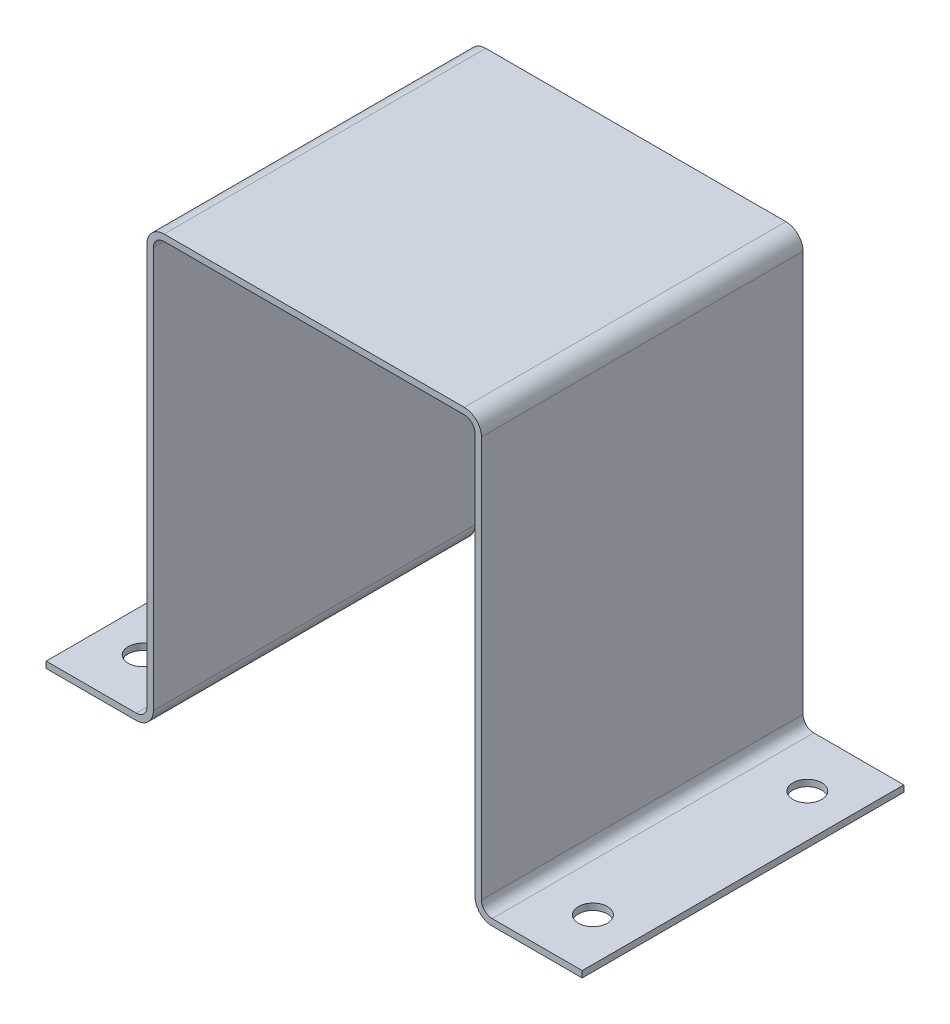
ISO-10303-21;
HEADER;
FILE_DESCRIPTION(('STEP AP214'),'2;1');
FILE_NAME('part.step','',(''),(''),'','','');
FILE_SCHEMA(('AUTOMOTIVE_DESIGN { 1 0 10303 214 1 1 1 1 }'));
ENDSEC;
DATA;
#1=APPLICATION_CONTEXT('core data for automotive mechanical design processes');
#2=APPLICATION_PROTOCOL_DEFINITION('international standard','automotive_design',2000,#1);
#3=PRODUCT_CONTEXT('',#1,'mechanical');
#4=PRODUCT('Part','Part','',(#3));
#5=PRODUCT_RELATED_PRODUCT_CATEGORY('part','',(#4));
#6=PRODUCT_DEFINITION_FORMATION('','',#4);
#7=PRODUCT_DEFINITION_CONTEXT('part definition',#1,'design');
#8=PRODUCT_DEFINITION('design','',#6,#7);
#9=PRODUCT_DEFINITION_SHAPE('','',#8);
#10=(LENGTH_UNIT() NAMED_UNIT(*) SI_UNIT(.MILLI.,.METRE.));
#11=(NAMED_UNIT(*) PLANE_ANGLE_UNIT() SI_UNIT($,.RADIAN.));
#12=(NAMED_UNIT(*) SI_UNIT($,.STERADIAN.) SOLID_ANGLE_UNIT());
#13=UNCERTAINTY_MEASURE_WITH_UNIT(LENGTH_MEASURE(1.E-05),#10,'distance_accuracy_value','');
#14=(GEOMETRIC_REPRESENTATION_CONTEXT(3) GLOBAL_UNCERTAINTY_ASSIGNED_CONTEXT((#13)) GLOBAL_UNIT_ASSIGNED_CONTEXT((#10,
#11,#12)) REPRESENTATION_CONTEXT('',''));
#15=CARTESIAN_POINT('',(0.,0.,0.));
#16=DIRECTION('',(0.,0.,1.));
#17=DIRECTION('',(1.,0.,0.));
#18=AXIS2_PLACEMENT_3D('',#15,#16,#17);
#19=CARTESIAN_POINT('',(-83.,-197.,75.));
#20=DIRECTION('',(0.,-1.,0.));
#21=DIRECTION('',(0.,0.,-1.));
#22=AXIS2_PLACEMENT_3D('',#19,#20,#21);
#23=PLANE('',#22);
#24=CARTESIAN_POINT('',(-105.,-197.,-50.));
#25=DIRECTION('',(0.,1.,0.));
#26=DIRECTION('',(0.,0.,1.));
#27=AXIS2_PLACEMENT_3D('',#24,#25,#26);
#28=CIRCLE('',#27,6.75000000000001);
#29=CARTESIAN_POINT('',(-105.,-197.,-43.25));
#30=VERTEX_POINT('',#29);
#31=EDGE_CURVE('E372',#30,#30,#28,.T.);
#32=ORIENTED_EDGE('',*,*,#31,.F.);
#33=EDGE_LOOP('',(#32));
#34=FACE_BOUND('',#33,.T.);
#35=CARTESIAN_POINT('',(-105.,-197.,50.));
#36=DIRECTION('',(0.,1.,0.));
#37=DIRECTION('',(0.,0.,1.));
#38=AXIS2_PLACEMENT_3D('',#35,#36,#37);
#39=CIRCLE('',#38,6.75000000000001);
#40=CARTESIAN_POINT('',(-105.,-197.,56.75));
#41=VERTEX_POINT('',#40);
#42=EDGE_CURVE('E375',#41,#41,#39,.T.);
#43=ORIENTED_EDGE('',*,*,#42,.F.);
#44=EDGE_LOOP('',(#43));
#45=FACE_BOUND('',#44,.T.);
#46=DIRECTION('',(1.,0.,0.));
#47=VECTOR('',#46,1.);
#48=CARTESIAN_POINT('',(-83.,-197.,-75.));
#49=LINE('',#48,#47);
#50=CARTESIAN_POINT('',(-83.,-197.,-75.));
#51=VERTEX_POINT('',#50);
#52=CARTESIAN_POINT('',(-125.,-197.,-75.));
#53=VERTEX_POINT('',#52);
#54=EDGE_CURVE('E201',#51,#53,#49,.F.);
#55=ORIENTED_EDGE('',*,*,#54,.T.);
#56=DIRECTION('',(0.,0.,-1.));
#57=VECTOR('',#56,1.);
#58=CARTESIAN_POINT('',(-125.,-197.,75.));
#59=LINE('',#58,#57);
#60=CARTESIAN_POINT('',(-125.,-197.,75.));
#61=VERTEX_POINT('',#60);
#62=EDGE_CURVE('E11',#61,#53,#59,.T.);
#63=ORIENTED_EDGE('',*,*,#62,.F.);
#64=DIRECTION('',(1.,0.,0.));
#65=VECTOR('',#64,1.);
#66=CARTESIAN_POINT('',(-83.,-197.,75.));
#67=LINE('',#66,#65);
#68=CARTESIAN_POINT('',(-83.,-197.,75.));
#69=VERTEX_POINT('',#68);
#70=EDGE_CURVE('E126',#69,#61,#67,.F.);
#71=ORIENTED_EDGE('',*,*,#70,.F.);
#72=DIRECTION('',(0.,0.,-1.));
#73=VECTOR('',#72,1.);
#74=CARTESIAN_POINT('',(-83.,-197.,75.));
#75=LINE('',#74,#73);
#76=EDGE_CURVE('E197',#69,#51,#75,.T.);
#77=ORIENTED_EDGE('',*,*,#76,.T.);
#78=EDGE_LOOP('',(#55,#63,#71,#77));
#79=FACE_BOUND('',#78,.T.);
#80=ADVANCED_FACE('F34',(#34,#45,#79),#23,.F.);
#81=CARTESIAN_POINT('',(-125.,-200.,75.));
#82=DIRECTION('',(-1.,0.,0.));
#83=DIRECTION('',(0.,0.,1.));
#84=AXIS2_PLACEMENT_3D('',#81,#82,#83);
#85=PLANE('',#84);
#86=DIRECTION('',(0.,1.,0.));
#87=VECTOR('',#86,1.);
#88=CARTESIAN_POINT('',(-125.,-200.,-75.));
#89=LINE('',#88,#87);
#90=CARTESIAN_POINT('',(-125.,-200.,-75.));
#91=VERTEX_POINT('',#90);
#92=EDGE_CURVE('E204',#91,#53,#89,.T.);
#93=ORIENTED_EDGE('',*,*,#92,.F.);
#94=DIRECTION('',(0.,0.,-1.));
#95=VECTOR('',#94,1.);
#96=CARTESIAN_POINT('',(-125.,-200.,75.));
#97=LINE('',#96,#95);
#98=CARTESIAN_POINT('',(-125.,-200.,75.));
#99=VERTEX_POINT('',#98);
#100=EDGE_CURVE('E42',#99,#91,#97,.T.);
#101=ORIENTED_EDGE('',*,*,#100,.F.);
#102=DIRECTION('',(0.,1.,0.));
#103=VECTOR('',#102,1.);
#104=CARTESIAN_POINT('',(-125.,-200.,75.));
#105=LINE('',#104,#103);
#106=EDGE_CURVE('E307',#99,#61,#105,.T.);
#107=ORIENTED_EDGE('',*,*,#106,.T.);
#108=ORIENTED_EDGE('',*,*,#62,.T.);
#109=EDGE_LOOP('',(#93,#101,#107,#108));
#110=FACE_BOUND('',#109,.T.);
#111=ADVANCED_FACE('F294',(#110),#85,.T.);
#112=CARTESIAN_POINT('',(-83.,-200.,75.));
#113=DIRECTION('',(0.,-1.,0.));
#114=DIRECTION('',(0.,0.,-1.));
#115=AXIS2_PLACEMENT_3D('',#112,#113,#114);
#116=PLANE('',#115);
#117=CARTESIAN_POINT('',(-105.,-200.,-50.));
#118=DIRECTION('',(0.,1.,0.));
#119=DIRECTION('',(0.,0.,1.));
#120=AXIS2_PLACEMENT_3D('',#117,#118,#119);
#121=CIRCLE('',#120,6.75000000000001);
#122=CARTESIAN_POINT('',(-105.,-200.,-43.25));
#123=VERTEX_POINT('',#122);
#124=EDGE_CURVE('E378',#123,#123,#121,.T.);
#125=ORIENTED_EDGE('',*,*,#124,.T.);
#126=EDGE_LOOP('',(#125));
#127=FACE_BOUND('',#126,.T.);
#128=CARTESIAN_POINT('',(-105.,-200.,50.));
#129=DIRECTION('',(0.,1.,0.));
#130=DIRECTION('',(0.,0.,1.));
#131=AXIS2_PLACEMENT_3D('',#128,#129,#130);
#132=CIRCLE('',#131,6.75000000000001);
#133=CARTESIAN_POINT('',(-105.,-200.,56.75));
#134=VERTEX_POINT('',#133);
#135=EDGE_CURVE('E377',#134,#134,#132,.T.);
#136=ORIENTED_EDGE('',*,*,#135,.T.);
#137=EDGE_LOOP('',(#136));
#138=FACE_BOUND('',#137,.T.);
#139=DIRECTION('',(-1.,0.,0.));
#140=VECTOR('',#139,1.);
#141=CARTESIAN_POINT('',(-83.,-200.,-75.));
#142=LINE('',#141,#140);
#143=CARTESIAN_POINT('',(-83.,-200.,-75.));
#144=VERTEX_POINT('',#143);
#145=EDGE_CURVE('E208',#144,#91,#142,.T.);
#146=ORIENTED_EDGE('',*,*,#145,.F.);
#147=DIRECTION('',(0.,0.,-1.));
#148=VECTOR('',#147,1.);
#149=CARTESIAN_POINT('',(-83.,-200.,75.));
#150=LINE('',#149,#148);
#151=CARTESIAN_POINT('',(-83.,-200.,75.));
#152=VERTEX_POINT('',#151);
#153=EDGE_CURVE('E284',#152,#144,#150,.T.);
#154=ORIENTED_EDGE('',*,*,#153,.F.);
#155=DIRECTION('',(-1.,0.,0.));
#156=VECTOR('',#155,1.);
#157=CARTESIAN_POINT('',(-83.,-200.,75.));
#158=LINE('',#157,#156);
#159=EDGE_CURVE('E291',#152,#99,#158,.T.);
#160=ORIENTED_EDGE('',*,*,#159,.T.);
#161=ORIENTED_EDGE('',*,*,#100,.T.);
#162=EDGE_LOOP('',(#146,#154,#160,#161));
#163=FACE_BOUND('',#162,.T.);
#164=ADVANCED_FACE('F289',(#127,#138,#163),#116,.T.);
#165=CARTESIAN_POINT('',(-83.,-192.,75.));
#166=DIRECTION('',(0.,0.,-1.));
#167=DIRECTION('',(-1.,0.,0.));
#168=AXIS2_PLACEMENT_3D('',#165,#166,#167);
#169=CYLINDRICAL_SURFACE('',#168,7.99999999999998);
#170=CARTESIAN_POINT('',(-83.,-192.,-75.));
#171=DIRECTION('',(0.,0.,-1.));
#172=DIRECTION('',(-1.,0.,0.));
#173=AXIS2_PLACEMENT_3D('',#170,#171,#172);
#174=CIRCLE('',#173,7.99999999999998);
#175=CARTESIAN_POINT('',(-75.,-192.,-75.));
#176=VERTEX_POINT('',#175);
#177=EDGE_CURVE('E211',#176,#144,#174,.T.);
#178=ORIENTED_EDGE('',*,*,#177,.F.);
#179=DIRECTION('',(0.,0.,-1.));
#180=VECTOR('',#179,1.);
#181=CARTESIAN_POINT('',(-75.,-192.,75.));
#182=LINE('',#181,#180);
#183=CARTESIAN_POINT('',(-75.,-192.,75.));
#184=VERTEX_POINT('',#183);
#185=EDGE_CURVE('E282',#184,#176,#182,.T.);
#186=ORIENTED_EDGE('',*,*,#185,.F.);
#187=CARTESIAN_POINT('',(-83.,-192.,75.));
#188=DIRECTION('',(0.,0.,-1.));
#189=DIRECTION('',(-1.,0.,0.));
#190=AXIS2_PLACEMENT_3D('',#187,#188,#189);
#191=CIRCLE('',#190,7.99999999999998);
#192=EDGE_CURVE('E304',#184,#152,#191,.T.);
#193=ORIENTED_EDGE('',*,*,#192,.T.);
#194=ORIENTED_EDGE('',*,*,#153,.T.);
#195=EDGE_LOOP('',(#178,#186,#193,#194));
#196=FACE_BOUND('',#195,.T.);
#197=ADVANCED_FACE('F301',(#196),#169,.T.);
#198=CARTESIAN_POINT('',(-75.,-5.,75.));
#199=DIRECTION('',(1.,0.,0.));
#200=DIRECTION('',(0.,1.,0.));
#201=AXIS2_PLACEMENT_3D('',#198,#199,#200);
#202=PLANE('',#201);
#203=DIRECTION('',(0.,-1.,0.));
#204=VECTOR('',#203,1.);
#205=CARTESIAN_POINT('',(-75.,-5.,-75.));
#206=LINE('',#205,#204);
#207=CARTESIAN_POINT('',(-75.,-5.,-75.));
#208=VERTEX_POINT('',#207);
#209=EDGE_CURVE('E214',#208,#176,#206,.T.);
#210=ORIENTED_EDGE('',*,*,#209,.F.);
#211=DIRECTION('',(0.,0.,-1.));
#212=VECTOR('',#211,1.);
#213=CARTESIAN_POINT('',(-75.,-5.,75.));
#214=LINE('',#213,#212);
#215=CARTESIAN_POINT('',(-75.,-5.,75.));
#216=VERTEX_POINT('',#215);
#217=EDGE_CURVE('E280',#216,#208,#214,.T.);
#218=ORIENTED_EDGE('',*,*,#217,.F.);
#219=DIRECTION('',(0.,-1.,0.));
#220=VECTOR('',#219,1.);
#221=CARTESIAN_POINT('',(-75.,-5.,75.));
#222=LINE('',#221,#220);
#223=EDGE_CURVE('E309',#216,#184,#222,.T.);
#224=ORIENTED_EDGE('',*,*,#223,.T.);
#225=ORIENTED_EDGE('',*,*,#185,.T.);
#226=EDGE_LOOP('',(#210,#218,#224,#225));
#227=FACE_BOUND('',#226,.T.);
#228=ADVANCED_FACE('F461',(#227),#202,.T.);
#229=CARTESIAN_POINT('',(-70.,-5.,75.));
#230=DIRECTION('',(0.,0.,-1.));
#231=DIRECTION('',(-1.,0.,0.));
#232=AXIS2_PLACEMENT_3D('',#229,#230,#231);
#233=CYLINDRICAL_SURFACE('',#232,5.);
#234=CARTESIAN_POINT('',(-70.,-5.,-75.));
#235=DIRECTION('',(0.,0.,1.));
#236=DIRECTION('',(1.,0.,0.));
#237=AXIS2_PLACEMENT_3D('',#234,#235,#236);
#238=CIRCLE('',#237,5.);
#239=CARTESIAN_POINT('',(-70.,0.,-75.));
#240=VERTEX_POINT('',#239);
#241=EDGE_CURVE('E217',#240,#208,#238,.T.);
#242=ORIENTED_EDGE('',*,*,#241,.F.);
#243=DIRECTION('',(0.,0.,-1.));
#244=VECTOR('',#243,1.);
#245=CARTESIAN_POINT('',(-70.,0.,75.));
#246=LINE('',#245,#244);
#247=CARTESIAN_POINT('',(-70.,0.,75.));
#248=VERTEX_POINT('',#247);
#249=EDGE_CURVE('E278',#248,#240,#246,.T.);
#250=ORIENTED_EDGE('',*,*,#249,.F.);
#251=CARTESIAN_POINT('',(-70.,-5.,75.));
#252=DIRECTION('',(0.,0.,1.));
#253=DIRECTION('',(1.,0.,0.));
#254=AXIS2_PLACEMENT_3D('',#251,#252,#253);
#255=CIRCLE('',#254,5.);
#256=EDGE_CURVE('E315',#248,#216,#255,.T.);
#257=ORIENTED_EDGE('',*,*,#256,.T.);
#258=ORIENTED_EDGE('',*,*,#217,.T.);
#259=EDGE_LOOP('',(#242,#250,#257,#258));
#260=FACE_BOUND('',#259,.T.);
#261=ADVANCED_FACE('F457',(#260),#233,.F.);
#262=CARTESIAN_POINT('',(-70.,0.,75.));
#263=DIRECTION('',(0.,-1.,0.));
#264=DIRECTION('',(0.,0.,-1.));
#265=AXIS2_PLACEMENT_3D('',#262,#263,#264);
#266=PLANE('',#265);
#267=DIRECTION('',(-1.,0.,0.));
#268=VECTOR('',#267,1.);
#269=CARTESIAN_POINT('',(-70.,0.,-75.));
#270=LINE('',#269,#268);
#271=CARTESIAN_POINT('',(70.,0.,-75.));
#272=VERTEX_POINT('',#271);
#273=EDGE_CURVE('E220',#272,#240,#270,.T.);
#274=ORIENTED_EDGE('',*,*,#273,.F.);
#275=DIRECTION('',(0.,0.,-1.));
#276=VECTOR('',#275,1.);
#277=CARTESIAN_POINT('',(70.,0.,75.));
#278=LINE('',#277,#276);
#279=CARTESIAN_POINT('',(70.,0.,75.));
#280=VERTEX_POINT('',#279);
#281=EDGE_CURVE('E276',#280,#272,#278,.T.);
#282=ORIENTED_EDGE('',*,*,#281,.F.);
#283=DIRECTION('',(-1.,0.,0.));
#284=VECTOR('',#283,1.);
#285=CARTESIAN_POINT('',(-70.,0.,75.));
#286=LINE('',#285,#284);
#287=EDGE_CURVE('E318',#280,#248,#286,.T.);
#288=ORIENTED_EDGE('',*,*,#287,.T.);
#289=ORIENTED_EDGE('',*,*,#249,.T.);
#290=EDGE_LOOP('',(#274,#282,#288,#289));
#291=FACE_BOUND('',#290,.T.);
#292=ADVANCED_FACE('F453',(#291),#266,.T.);
#293=CARTESIAN_POINT('',(70.,-5.,75.));
#294=DIRECTION('',(0.,0.,-1.));
#295=DIRECTION('',(-1.,0.,0.));
#296=AXIS2_PLACEMENT_3D('',#293,#294,#295);
#297=CYLINDRICAL_SURFACE('',#296,5.);
#298=CARTESIAN_POINT('',(70.,-5.,-75.));
#299=DIRECTION('',(0.,0.,1.));
#300=DIRECTION('',(-1.,0.,0.));
#301=AXIS2_PLACEMENT_3D('',#298,#299,#300);
#302=CIRCLE('',#301,5.);
#303=CARTESIAN_POINT('',(75.,-5.,-75.));
#304=VERTEX_POINT('',#303);
#305=EDGE_CURVE('E223',#304,#272,#302,.T.);
#306=ORIENTED_EDGE('',*,*,#305,.F.);
#307=DIRECTION('',(0.,0.,-1.));
#308=VECTOR('',#307,1.);
#309=CARTESIAN_POINT('',(75.,-5.,75.));
#310=LINE('',#309,#308);
#311=CARTESIAN_POINT('',(75.,-5.,75.));
#312=VERTEX_POINT('',#311);
#313=EDGE_CURVE('E274',#312,#304,#310,.T.);
#314=ORIENTED_EDGE('',*,*,#313,.F.);
#315=CARTESIAN_POINT('',(70.,-5.,75.));
#316=DIRECTION('',(0.,0.,1.));
#317=DIRECTION('',(-1.,0.,0.));
#318=AXIS2_PLACEMENT_3D('',#315,#316,#317);
#319=CIRCLE('',#318,5.);
#320=EDGE_CURVE('E321',#312,#280,#319,.T.);
#321=ORIENTED_EDGE('',*,*,#320,.T.);
#322=ORIENTED_EDGE('',*,*,#281,.T.);
#323=EDGE_LOOP('',(#306,#314,#321,#322));
#324=FACE_BOUND('',#323,.T.);
#325=ADVANCED_FACE('F449',(#324),#297,.F.);
#326=CARTESIAN_POINT('',(75.,-5.,75.));
#327=DIRECTION('',(-1.,0.,0.));
#328=DIRECTION('',(0.,-1.,0.));
#329=AXIS2_PLACEMENT_3D('',#326,#327,#328);
#330=PLANE('',#329);
#331=DIRECTION('',(0.,1.,0.));
#332=VECTOR('',#331,1.);
#333=CARTESIAN_POINT('',(75.,-5.,-75.));
#334=LINE('',#333,#332);
#335=CARTESIAN_POINT('',(75.,-192.,-75.));
#336=VERTEX_POINT('',#335);
#337=EDGE_CURVE('E226',#336,#304,#334,.T.);
#338=ORIENTED_EDGE('',*,*,#337,.F.);
#339=DIRECTION('',(0.,0.,-1.));
#340=VECTOR('',#339,1.);
#341=CARTESIAN_POINT('',(75.,-192.,75.));
#342=LINE('',#341,#340);
#343=CARTESIAN_POINT('',(75.,-192.,75.));
#344=VERTEX_POINT('',#343);
#345=EDGE_CURVE('E272',#344,#336,#342,.T.);
#346=ORIENTED_EDGE('',*,*,#345,.F.);
#347=DIRECTION('',(0.,1.,0.));
#348=VECTOR('',#347,1.);
#349=CARTESIAN_POINT('',(75.,-5.,75.));
#350=LINE('',#349,#348);
#351=EDGE_CURVE('E324',#344,#312,#350,.T.);
#352=ORIENTED_EDGE('',*,*,#351,.T.);
#353=ORIENTED_EDGE('',*,*,#313,.T.);
#354=EDGE_LOOP('',(#338,#346,#352,#353));
#355=FACE_BOUND('',#354,.T.);
#356=ADVANCED_FACE('F445',(#355),#330,.T.);
#357=CARTESIAN_POINT('',(83.,-192.,75.));
#358=DIRECTION('',(0.,0.,-1.));
#359=DIRECTION('',(-1.,0.,0.));
#360=AXIS2_PLACEMENT_3D('',#357,#358,#359);
#361=CYLINDRICAL_SURFACE('',#360,8.00000000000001);
#362=CARTESIAN_POINT('',(83.,-192.,-75.));
#363=DIRECTION('',(0.,0.,-1.));
#364=DIRECTION('',(1.,0.,0.));
#365=AXIS2_PLACEMENT_3D('',#362,#363,#364);
#366=CIRCLE('',#365,8.00000000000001);
#367=CARTESIAN_POINT('',(83.,-200.,-75.));
#368=VERTEX_POINT('',#367);
#369=EDGE_CURVE('E229',#368,#336,#366,.T.);
#370=ORIENTED_EDGE('',*,*,#369,.F.);
#371=DIRECTION('',(0.,0.,-1.));
#372=VECTOR('',#371,1.);
#373=CARTESIAN_POINT('',(83.,-200.,75.));
#374=LINE('',#373,#372);
#375=CARTESIAN_POINT('',(83.,-200.,75.));
#376=VERTEX_POINT('',#375);
#377=EDGE_CURVE('E270',#376,#368,#374,.T.);
#378=ORIENTED_EDGE('',*,*,#377,.F.);
#379=CARTESIAN_POINT('',(83.,-192.,75.));
#380=DIRECTION('',(0.,0.,-1.));
#381=DIRECTION('',(1.,0.,0.));
#382=AXIS2_PLACEMENT_3D('',#379,#380,#381);
#383=CIRCLE('',#382,8.00000000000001);
#384=EDGE_CURVE('E327',#376,#344,#383,.T.);
#385=ORIENTED_EDGE('',*,*,#384,.T.);
#386=ORIENTED_EDGE('',*,*,#345,.T.);
#387=EDGE_LOOP('',(#370,#378,#385,#386));
#388=FACE_BOUND('',#387,.T.);
#389=ADVANCED_FACE('F441',(#388),#361,.T.);
#390=CARTESIAN_POINT('',(83.,-200.,75.));
#391=DIRECTION('',(0.,-1.,0.));
#392=DIRECTION('',(0.,0.,-1.));
#393=AXIS2_PLACEMENT_3D('',#390,#391,#392);
#394=PLANE('',#393);
#395=CARTESIAN_POINT('',(105.,-200.,50.));
#396=DIRECTION('',(0.,1.,0.));
#397=DIRECTION('',(0.,0.,1.));
#398=AXIS2_PLACEMENT_3D('',#395,#396,#397);
#399=CIRCLE('',#398,6.75000000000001);
#400=CARTESIAN_POINT('',(105.,-200.,56.75));
#401=VERTEX_POINT('',#400);
#402=EDGE_CURVE('E389',#401,#401,#399,.T.);
#403=ORIENTED_EDGE('',*,*,#402,.T.);
#404=EDGE_LOOP('',(#403));
#405=FACE_BOUND('',#404,.T.);
#406=CARTESIAN_POINT('',(105.,-200.,-50.));
#407=DIRECTION('',(0.,1.,0.));
#408=DIRECTION('',(0.,0.,1.));
#409=AXIS2_PLACEMENT_3D('',#406,#407,#408);
#410=CIRCLE('',#409,6.75000000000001);
#411=CARTESIAN_POINT('',(105.,-200.,-43.25));
#412=VERTEX_POINT('',#411);
#413=EDGE_CURVE('E205',#412,#412,#410,.T.);
#414=ORIENTED_EDGE('',*,*,#413,.T.);
#415=EDGE_LOOP('',(#414));
#416=FACE_BOUND('',#415,.T.);
#417=DIRECTION('',(-1.,0.,0.));
#418=VECTOR('',#417,1.);
#419=CARTESIAN_POINT('',(83.,-200.,-75.));
#420=LINE('',#419,#418);
#421=CARTESIAN_POINT('',(125.,-200.,-75.));
#422=VERTEX_POINT('',#421);
#423=EDGE_CURVE('E232',#422,#368,#420,.T.);
#424=ORIENTED_EDGE('',*,*,#423,.F.);
#425=DIRECTION('',(0.,0.,-1.));
#426=VECTOR('',#425,1.);
#427=CARTESIAN_POINT('',(125.,-200.,75.));
#428=LINE('',#427,#426);
#429=CARTESIAN_POINT('',(125.,-200.,75.));
#430=VERTEX_POINT('',#429);
#431=EDGE_CURVE('E268',#430,#422,#428,.T.);
#432=ORIENTED_EDGE('',*,*,#431,.F.);
#433=DIRECTION('',(-1.,0.,0.));
#434=VECTOR('',#433,1.);
#435=CARTESIAN_POINT('',(83.,-200.,75.));
#436=LINE('',#435,#434);
#437=EDGE_CURVE('E330',#430,#376,#436,.T.);
#438=ORIENTED_EDGE('',*,*,#437,.T.);
#439=ORIENTED_EDGE('',*,*,#377,.T.);
#440=EDGE_LOOP('',(#424,#432,#438,#439));
#441=FACE_BOUND('',#440,.T.);
#442=ADVANCED_FACE('F398',(#405,#416,#441),#394,.T.);
#443=CARTESIAN_POINT('',(125.,-197.,75.));
#444=DIRECTION('',(1.,0.,0.));
#445=DIRECTION('',(0.,0.,-1.));
#446=AXIS2_PLACEMENT_3D('',#443,#444,#445);
#447=PLANE('',#446);
#448=DIRECTION('',(0.,-1.,0.));
#449=VECTOR('',#448,1.);
#450=CARTESIAN_POINT('',(125.,-197.,-75.));
#451=LINE('',#450,#449);
#452=CARTESIAN_POINT('',(125.,-197.,-75.));
#453=VERTEX_POINT('',#452);
#454=EDGE_CURVE('E235',#453,#422,#451,.T.);
#455=ORIENTED_EDGE('',*,*,#454,.F.);
#456=DIRECTION('',(0.,0.,-1.));
#457=VECTOR('',#456,1.);
#458=CARTESIAN_POINT('',(125.,-197.,75.));
#459=LINE('',#458,#457);
#460=CARTESIAN_POINT('',(125.,-197.,75.));
#461=VERTEX_POINT('',#460);
#462=EDGE_CURVE('E266',#461,#453,#459,.T.);
#463=ORIENTED_EDGE('',*,*,#462,.F.);
#464=DIRECTION('',(0.,-1.,0.));
#465=VECTOR('',#464,1.);
#466=CARTESIAN_POINT('',(125.,-197.,75.));
#467=LINE('',#466,#465);
#468=EDGE_CURVE('E333',#461,#430,#467,.T.);
#469=ORIENTED_EDGE('',*,*,#468,.T.);
#470=ORIENTED_EDGE('',*,*,#431,.T.);
#471=EDGE_LOOP('',(#455,#463,#469,#470));
#472=FACE_BOUND('',#471,.T.);
#473=ADVANCED_FACE('F412',(#472),#447,.T.);
#474=CARTESIAN_POINT('',(83.,-197.,75.));
#475=DIRECTION('',(0.,-1.,0.));
#476=DIRECTION('',(0.,0.,-1.));
#477=AXIS2_PLACEMENT_3D('',#474,#475,#476);
#478=PLANE('',#477);
#479=CARTESIAN_POINT('',(105.,-197.,50.));
#480=DIRECTION('',(0.,1.,0.));
#481=DIRECTION('',(0.,0.,1.));
#482=AXIS2_PLACEMENT_3D('',#479,#480,#481);
#483=CIRCLE('',#482,6.75000000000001);
#484=CARTESIAN_POINT('',(105.,-197.,56.75));
#485=VERTEX_POINT('',#484);
#486=EDGE_CURVE('E381',#485,#485,#483,.T.);
#487=ORIENTED_EDGE('',*,*,#486,.F.);
#488=EDGE_LOOP('',(#487));
#489=FACE_BOUND('',#488,.T.);
#490=CARTESIAN_POINT('',(105.,-197.,-50.));
#491=DIRECTION('',(0.,1.,0.));
#492=DIRECTION('',(0.,0.,1.));
#493=AXIS2_PLACEMENT_3D('',#490,#491,#492);
#494=CIRCLE('',#493,6.75000000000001);
#495=CARTESIAN_POINT('',(105.,-197.,-43.25));
#496=VERTEX_POINT('',#495);
#497=EDGE_CURVE('E392',#496,#496,#494,.T.);
#498=ORIENTED_EDGE('',*,*,#497,.F.);
#499=EDGE_LOOP('',(#498));
#500=FACE_BOUND('',#499,.T.);
#501=DIRECTION('',(1.,0.,0.));
#502=VECTOR('',#501,1.);
#503=CARTESIAN_POINT('',(83.,-197.,-75.));
#504=LINE('',#503,#502);
#505=CARTESIAN_POINT('',(83.,-197.,-75.));
#506=VERTEX_POINT('',#505);
#507=EDGE_CURVE('E238',#453,#506,#504,.F.);
#508=ORIENTED_EDGE('',*,*,#507,.T.);
#509=DIRECTION('',(0.,0.,-1.));
#510=VECTOR('',#509,1.);
#511=CARTESIAN_POINT('',(83.,-197.,75.));
#512=LINE('',#511,#510);
#513=CARTESIAN_POINT('',(83.,-197.,75.));
#514=VERTEX_POINT('',#513);
#515=EDGE_CURVE('E263',#514,#506,#512,.T.);
#516=ORIENTED_EDGE('',*,*,#515,.F.);
#517=DIRECTION('',(1.,0.,0.));
#518=VECTOR('',#517,1.);
#519=CARTESIAN_POINT('',(83.,-197.,75.));
#520=LINE('',#519,#518);
#521=EDGE_CURVE('E336',#461,#514,#520,.F.);
#522=ORIENTED_EDGE('',*,*,#521,.F.);
#523=ORIENTED_EDGE('',*,*,#462,.T.);
#524=EDGE_LOOP('',(#508,#516,#522,#523));
#525=FACE_BOUND('',#524,.T.);
#526=ADVANCED_FACE('F408',(#489,#500,#525),#478,.F.);
#527=CARTESIAN_POINT('',(83.,-192.,75.));
#528=DIRECTION('',(0.,0.,-1.));
#529=DIRECTION('',(-1.,0.,0.));
#530=AXIS2_PLACEMENT_3D('',#527,#528,#529);
#531=CYLINDRICAL_SURFACE('',#530,5.00000000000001);
#532=CARTESIAN_POINT('',(83.,-192.,-75.));
#533=DIRECTION('',(0.,0.,1.));
#534=DIRECTION('',(1.,0.,0.));
#535=AXIS2_PLACEMENT_3D('',#532,#533,#534);
#536=CIRCLE('',#535,5.00000000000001);
#537=CARTESIAN_POINT('',(78.,-192.,-75.));
#538=VERTEX_POINT('',#537);
#539=EDGE_CURVE('E240',#506,#538,#536,.F.);
#540=ORIENTED_EDGE('',*,*,#539,.T.);
#541=DIRECTION('',(0.,0.,-1.));
#542=VECTOR('',#541,1.);
#543=CARTESIAN_POINT('',(78.,-192.,75.));
#544=LINE('',#543,#542);
#545=CARTESIAN_POINT('',(78.,-192.,75.));
#546=VERTEX_POINT('',#545);
#547=EDGE_CURVE('E260',#546,#538,#544,.T.);
#548=ORIENTED_EDGE('',*,*,#547,.F.);
#549=CARTESIAN_POINT('',(83.,-192.,75.));
#550=DIRECTION('',(0.,0.,1.));
#551=DIRECTION('',(1.,0.,0.));
#552=AXIS2_PLACEMENT_3D('',#549,#550,#551);
#553=CIRCLE('',#552,5.00000000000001);
#554=EDGE_CURVE('E338',#514,#546,#553,.F.);
#555=ORIENTED_EDGE('',*,*,#554,.F.);
#556=ORIENTED_EDGE('',*,*,#515,.T.);
#557=EDGE_LOOP('',(#540,#548,#555,#556));
#558=FACE_BOUND('',#557,.T.);
#559=ADVANCED_FACE('F411',(#558),#531,.F.);
#560=CARTESIAN_POINT('',(78.,-5.,75.));
#561=DIRECTION('',(-1.,0.,0.));
#562=DIRECTION('',(0.,-1.,0.));
#563=AXIS2_PLACEMENT_3D('',#560,#561,#562);
#564=PLANE('',#563);
#565=DIRECTION('',(0.,1.,0.));
#566=VECTOR('',#565,1.);
#567=CARTESIAN_POINT('',(78.,-5.,-75.));
#568=LINE('',#567,#566);
#569=CARTESIAN_POINT('',(78.,-5.,-75.));
#570=VERTEX_POINT('',#569);
#571=EDGE_CURVE('E242',#538,#570,#568,.T.);
#572=ORIENTED_EDGE('',*,*,#571,.T.);
#573=DIRECTION('',(0.,0.,-1.));
#574=VECTOR('',#573,1.);
#575=CARTESIAN_POINT('',(78.,-5.,75.));
#576=LINE('',#575,#574);
#577=CARTESIAN_POINT('',(78.,-5.,75.));
#578=VERTEX_POINT('',#577);
#579=EDGE_CURVE('E257',#578,#570,#576,.T.);
#580=ORIENTED_EDGE('',*,*,#579,.F.);
#581=DIRECTION('',(0.,1.,0.));
#582=VECTOR('',#581,1.);
#583=CARTESIAN_POINT('',(78.,-5.,75.));
#584=LINE('',#583,#582);
#585=EDGE_CURVE('E340',#546,#578,#584,.T.);
#586=ORIENTED_EDGE('',*,*,#585,.F.);
#587=ORIENTED_EDGE('',*,*,#547,.T.);
#588=EDGE_LOOP('',(#572,#580,#586,#587));
#589=FACE_BOUND('',#588,.T.);
#590=ADVANCED_FACE('F425',(#589),#564,.F.);
#591=CARTESIAN_POINT('',(70.,-5.,75.));
#592=DIRECTION('',(0.,0.,-1.));
#593=DIRECTION('',(-1.,0.,0.));
#594=AXIS2_PLACEMENT_3D('',#591,#592,#593);
#595=CYLINDRICAL_SURFACE('',#594,8.);
#596=CARTESIAN_POINT('',(70.,-5.,-75.));
#597=DIRECTION('',(0.,0.,1.));
#598=DIRECTION('',(1.,0.,0.));
#599=AXIS2_PLACEMENT_3D('',#596,#597,#598);
#600=CIRCLE('',#599,8.);
#601=CARTESIAN_POINT('',(70.,3.,-75.));
#602=VERTEX_POINT('',#601);
#603=EDGE_CURVE('E244',#570,#602,#600,.T.);
#604=ORIENTED_EDGE('',*,*,#603,.T.);
#605=DIRECTION('',(0.,0.,-1.));
#606=VECTOR('',#605,1.);
#607=CARTESIAN_POINT('',(70.,3.,75.));
#608=LINE('',#607,#606);
#609=CARTESIAN_POINT('',(70.,3.,75.));
#610=VERTEX_POINT('',#609);
#611=EDGE_CURVE('E254',#610,#602,#608,.T.);
#612=ORIENTED_EDGE('',*,*,#611,.F.);
#613=CARTESIAN_POINT('',(70.,-5.,75.));
#614=DIRECTION('',(0.,0.,1.));
#615=DIRECTION('',(1.,0.,0.));
#616=AXIS2_PLACEMENT_3D('',#613,#614,#615);
#617=CIRCLE('',#616,8.);
#618=EDGE_CURVE('E342',#578,#610,#617,.T.);
#619=ORIENTED_EDGE('',*,*,#618,.F.);
#620=ORIENTED_EDGE('',*,*,#579,.T.);
#621=EDGE_LOOP('',(#604,#612,#619,#620));
#622=FACE_BOUND('',#621,.T.);
#623=ADVANCED_FACE('F348',(#622),#595,.T.);
#624=CARTESIAN_POINT('',(-70.,3.,75.));
#625=DIRECTION('',(0.,-1.,0.));
#626=DIRECTION('',(0.,0.,-1.));
#627=AXIS2_PLACEMENT_3D('',#624,#625,#626);
#628=PLANE('',#627);
#629=DIRECTION('',(1.,0.,0.));
#630=VECTOR('',#629,1.);
#631=CARTESIAN_POINT('',(-70.,3.,-75.));
#632=LINE('',#631,#630);
#633=CARTESIAN_POINT('',(-70.,3.,-75.));
#634=VERTEX_POINT('',#633);
#635=EDGE_CURVE('E246',#602,#634,#632,.F.);
#636=ORIENTED_EDGE('',*,*,#635,.T.);
#637=DIRECTION('',(0.,0.,-1.));
#638=VECTOR('',#637,1.);
#639=CARTESIAN_POINT('',(-70.,3.,75.));
#640=LINE('',#639,#638);
#641=CARTESIAN_POINT('',(-70.,3.,75.));
#642=VERTEX_POINT('',#641);
#643=EDGE_CURVE('E192',#642,#634,#640,.T.);
#644=ORIENTED_EDGE('',*,*,#643,.F.);
#645=DIRECTION('',(1.,0.,0.));
#646=VECTOR('',#645,1.);
#647=CARTESIAN_POINT('',(-70.,3.,75.));
#648=LINE('',#647,#646);
#649=EDGE_CURVE('E183',#610,#642,#648,.F.);
#650=ORIENTED_EDGE('',*,*,#649,.F.);
#651=ORIENTED_EDGE('',*,*,#611,.T.);
#652=EDGE_LOOP('',(#636,#644,#650,#651));
#653=FACE_BOUND('',#652,.T.);
#654=ADVANCED_FACE('F352',(#653),#628,.F.);
#655=CARTESIAN_POINT('',(-70.,-5.,75.));
#656=DIRECTION('',(0.,0.,-1.));
#657=DIRECTION('',(-1.,0.,0.));
#658=AXIS2_PLACEMENT_3D('',#655,#656,#657);
#659=CYLINDRICAL_SURFACE('',#658,8.);
#660=CARTESIAN_POINT('',(-70.,-5.,-75.));
#661=DIRECTION('',(0.,0.,1.));
#662=DIRECTION('',(1.,0.,0.));
#663=AXIS2_PLACEMENT_3D('',#660,#661,#662);
#664=CIRCLE('',#663,8.);
#665=CARTESIAN_POINT('',(-78.,-5.,-75.));
#666=VERTEX_POINT('',#665);
#667=EDGE_CURVE('E191',#634,#666,#664,.T.);
#668=ORIENTED_EDGE('',*,*,#667,.T.);
#669=DIRECTION('',(0.,0.,-1.));
#670=VECTOR('',#669,1.);
#671=CARTESIAN_POINT('',(-78.,-5.,75.));
#672=LINE('',#671,#670);
#673=CARTESIAN_POINT('',(-78.,-5.,75.));
#674=VERTEX_POINT('',#673);
#675=EDGE_CURVE('E188',#674,#666,#672,.T.);
#676=ORIENTED_EDGE('',*,*,#675,.F.);
#677=CARTESIAN_POINT('',(-70.,-5.,75.));
#678=DIRECTION('',(0.,0.,1.));
#679=DIRECTION('',(1.,0.,0.));
#680=AXIS2_PLACEMENT_3D('',#677,#678,#679);
#681=CIRCLE('',#680,8.);
#682=EDGE_CURVE('E177',#642,#674,#681,.T.);
#683=ORIENTED_EDGE('',*,*,#682,.F.);
#684=ORIENTED_EDGE('',*,*,#643,.T.);
#685=EDGE_LOOP('',(#668,#676,#683,#684));
#686=FACE_BOUND('',#685,.T.);
#687=ADVANCED_FACE('F189',(#686),#659,.T.);
#688=CARTESIAN_POINT('',(-78.,-5.,75.));
#689=DIRECTION('',(1.,0.,0.));
#690=DIRECTION('',(0.,1.,0.));
#691=AXIS2_PLACEMENT_3D('',#688,#689,#690);
#692=PLANE('',#691);
#693=DIRECTION('',(0.,-1.,0.));
#694=VECTOR('',#693,1.);
#695=CARTESIAN_POINT('',(-78.,-5.,-75.));
#696=LINE('',#695,#694);
#697=CARTESIAN_POINT('',(-78.,-192.,-75.));
#698=VERTEX_POINT('',#697);
#699=EDGE_CURVE('E114',#666,#698,#696,.T.);
#700=ORIENTED_EDGE('',*,*,#699,.T.);
#701=DIRECTION('',(0.,0.,-1.));
#702=VECTOR('',#701,1.);
#703=CARTESIAN_POINT('',(-78.,-192.,75.));
#704=LINE('',#703,#702);
#705=CARTESIAN_POINT('',(-78.,-192.,75.));
#706=VERTEX_POINT('',#705);
#707=EDGE_CURVE('E193',#706,#698,#704,.T.);
#708=ORIENTED_EDGE('',*,*,#707,.F.);
#709=DIRECTION('',(0.,-1.,0.));
#710=VECTOR('',#709,1.);
#711=CARTESIAN_POINT('',(-78.,-5.,75.));
#712=LINE('',#711,#710);
#713=EDGE_CURVE('E181',#674,#706,#712,.T.);
#714=ORIENTED_EDGE('',*,*,#713,.F.);
#715=ORIENTED_EDGE('',*,*,#675,.T.);
#716=EDGE_LOOP('',(#700,#708,#714,#715));
#717=FACE_BOUND('',#716,.T.);
#718=ADVANCED_FACE('F195',(#717),#692,.F.);
#719=CARTESIAN_POINT('',(-83.,-192.,75.));
#720=DIRECTION('',(0.,0.,-1.));
#721=DIRECTION('',(-1.,0.,0.));
#722=AXIS2_PLACEMENT_3D('',#719,#720,#721);
#723=CYLINDRICAL_SURFACE('',#722,4.99999999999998);
#724=CARTESIAN_POINT('',(-83.,-192.,-75.));
#725=DIRECTION('',(0.,0.,1.));
#726=DIRECTION('',(1.,0.,0.));
#727=AXIS2_PLACEMENT_3D('',#724,#725,#726);
#728=CIRCLE('',#727,4.99999999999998);
#729=EDGE_CURVE('E120',#698,#51,#728,.F.);
#730=ORIENTED_EDGE('',*,*,#729,.T.);
#731=ORIENTED_EDGE('',*,*,#76,.F.);
#732=CARTESIAN_POINT('',(-83.,-192.,75.));
#733=DIRECTION('',(0.,0.,1.));
#734=DIRECTION('',(1.,0.,0.));
#735=AXIS2_PLACEMENT_3D('',#732,#733,#734);
#736=CIRCLE('',#735,4.99999999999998);
#737=EDGE_CURVE('E50',#706,#69,#736,.F.);
#738=ORIENTED_EDGE('',*,*,#737,.F.);
#739=ORIENTED_EDGE('',*,*,#707,.T.);
#740=EDGE_LOOP('',(#730,#731,#738,#739));
#741=FACE_BOUND('',#740,.T.);
#742=ADVANCED_FACE('F354',(#741),#723,.F.);
#743=CARTESIAN_POINT('',(-83.,-192.,75.));
#744=DIRECTION('',(0.,0.,-1.));
#745=DIRECTION('',(-1.,0.,0.));
#746=AXIS2_PLACEMENT_3D('',#743,#744,#745);
#747=PLANE('',#746);
#748=ORIENTED_EDGE('',*,*,#70,.T.);
#749=ORIENTED_EDGE('',*,*,#106,.F.);
#750=ORIENTED_EDGE('',*,*,#159,.F.);
#751=ORIENTED_EDGE('',*,*,#192,.F.);
#752=ORIENTED_EDGE('',*,*,#223,.F.);
#753=ORIENTED_EDGE('',*,*,#256,.F.);
#754=ORIENTED_EDGE('',*,*,#287,.F.);
#755=ORIENTED_EDGE('',*,*,#320,.F.);
#756=ORIENTED_EDGE('',*,*,#351,.F.);
#757=ORIENTED_EDGE('',*,*,#384,.F.);
#758=ORIENTED_EDGE('',*,*,#437,.F.);
#759=ORIENTED_EDGE('',*,*,#468,.F.);
#760=ORIENTED_EDGE('',*,*,#521,.T.);
#761=ORIENTED_EDGE('',*,*,#554,.T.);
#762=ORIENTED_EDGE('',*,*,#585,.T.);
#763=ORIENTED_EDGE('',*,*,#618,.T.);
#764=ORIENTED_EDGE('',*,*,#649,.T.);
#765=ORIENTED_EDGE('',*,*,#682,.T.);
#766=ORIENTED_EDGE('',*,*,#713,.T.);
#767=ORIENTED_EDGE('',*,*,#737,.T.);
#768=EDGE_LOOP('',(#748,#749,#750,#751,#752,#753,#754,#755,#756,#757,#758,#759,#760,#761,#762,
#763,#764,#765,#766,#767));
#769=FACE_BOUND('',#768,.T.);
#770=ADVANCED_FACE('F179',(#769),#747,.F.);
#771=CARTESIAN_POINT('',(-83.,-192.,-75.));
#772=DIRECTION('',(0.,0.,-1.));
#773=DIRECTION('',(-1.,0.,0.));
#774=AXIS2_PLACEMENT_3D('',#771,#772,#773);
#775=PLANE('',#774);
#776=ORIENTED_EDGE('',*,*,#54,.F.);
#777=ORIENTED_EDGE('',*,*,#729,.F.);
#778=ORIENTED_EDGE('',*,*,#699,.F.);
#779=ORIENTED_EDGE('',*,*,#667,.F.);
#780=ORIENTED_EDGE('',*,*,#635,.F.);
#781=ORIENTED_EDGE('',*,*,#603,.F.);
#782=ORIENTED_EDGE('',*,*,#571,.F.);
#783=ORIENTED_EDGE('',*,*,#539,.F.);
#784=ORIENTED_EDGE('',*,*,#507,.F.);
#785=ORIENTED_EDGE('',*,*,#454,.T.);
#786=ORIENTED_EDGE('',*,*,#423,.T.);
#787=ORIENTED_EDGE('',*,*,#369,.T.);
#788=ORIENTED_EDGE('',*,*,#337,.T.);
#789=ORIENTED_EDGE('',*,*,#305,.T.);
#790=ORIENTED_EDGE('',*,*,#273,.T.);
#791=ORIENTED_EDGE('',*,*,#241,.T.);
#792=ORIENTED_EDGE('',*,*,#209,.T.);
#793=ORIENTED_EDGE('',*,*,#177,.T.);
#794=ORIENTED_EDGE('',*,*,#145,.T.);
#795=ORIENTED_EDGE('',*,*,#92,.T.);
#796=EDGE_LOOP('',(#776,#777,#778,#779,#780,#781,#782,#783,#784,#785,#786,#787,#788,#789,#790,
#791,#792,#793,#794,#795));
#797=FACE_BOUND('',#796,.T.);
#798=ADVANCED_FACE('F297',(#797),#775,.T.);
#799=CARTESIAN_POINT('',(105.,-197.,-50.));
#800=DIRECTION('',(0.,1.,0.));
#801=DIRECTION('',(0.,0.,1.));
#802=AXIS2_PLACEMENT_3D('',#799,#800,#801);
#803=CYLINDRICAL_SURFACE('',#802,6.75000000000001);
#804=ORIENTED_EDGE('',*,*,#413,.F.);
#805=EDGE_LOOP('',(#804));
#806=FACE_BOUND('',#805,.T.);
#807=ORIENTED_EDGE('',*,*,#497,.T.);
#808=EDGE_LOOP('',(#807));
#809=FACE_BOUND('',#808,.T.);
#810=ADVANCED_FACE('F401',(#806,#809),#803,.F.);
#811=CARTESIAN_POINT('',(105.,-197.,50.));
#812=DIRECTION('',(0.,1.,0.));
#813=DIRECTION('',(0.,0.,1.));
#814=AXIS2_PLACEMENT_3D('',#811,#812,#813);
#815=CYLINDRICAL_SURFACE('',#814,6.75000000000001);
#816=ORIENTED_EDGE('',*,*,#402,.F.);
#817=EDGE_LOOP('',(#816));
#818=FACE_BOUND('',#817,.T.);
#819=ORIENTED_EDGE('',*,*,#486,.T.);
#820=EDGE_LOOP('',(#819));
#821=FACE_BOUND('',#820,.T.);
#822=ADVANCED_FACE('F404',(#818,#821),#815,.F.);
#823=CARTESIAN_POINT('',(-105.,-197.,50.));
#824=DIRECTION('',(0.,1.,0.));
#825=DIRECTION('',(0.,0.,1.));
#826=AXIS2_PLACEMENT_3D('',#823,#824,#825);
#827=CYLINDRICAL_SURFACE('',#826,6.75000000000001);
#828=ORIENTED_EDGE('',*,*,#135,.F.);
#829=EDGE_LOOP('',(#828));
#830=FACE_BOUND('',#829,.T.);
#831=ORIENTED_EDGE('',*,*,#42,.T.);
#832=EDGE_LOOP('',(#831));
#833=FACE_BOUND('',#832,.T.);
#834=ADVANCED_FACE('F476',(#830,#833),#827,.F.);
#835=CARTESIAN_POINT('',(-105.,-197.,-50.));
#836=DIRECTION('',(0.,1.,0.));
#837=DIRECTION('',(0.,0.,1.));
#838=AXIS2_PLACEMENT_3D('',#835,#836,#837);
#839=CYLINDRICAL_SURFACE('',#838,6.75000000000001);
#840=ORIENTED_EDGE('',*,*,#124,.F.);
#841=EDGE_LOOP('',(#840));
#842=FACE_BOUND('',#841,.T.);
#843=ORIENTED_EDGE('',*,*,#31,.T.);
#844=EDGE_LOOP('',(#843));
#845=FACE_BOUND('',#844,.T.);
#846=ADVANCED_FACE('F478',(#842,#845),#839,.F.);
#847=CLOSED_SHELL('',(#80,#111,#164,#197,#228,#261,#292,#325,#356,#389,#442,#473,#526,#559,#590,
#623,#654,#687,#718,#742,#770,#798,#810,#822,#834,#846));
#848=MANIFOLD_SOLID_BREP('B2',#847);
#849=ADVANCED_BREP_SHAPE_REPRESENTATION('',(#18,#848),#14);
#850=SHAPE_DEFINITION_REPRESENTATION(#9,#849);
ENDSEC;
END-ISO-10303-21;
